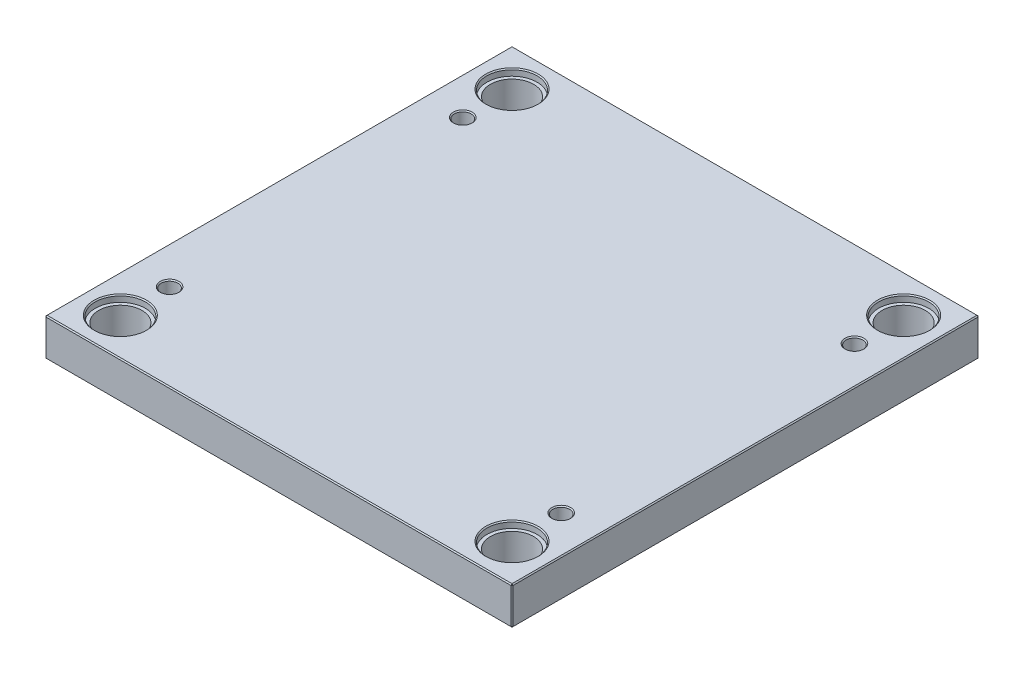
ISO-10303-21;
HEADER;
FILE_DESCRIPTION(('STEP AP214'),'2;1');
FILE_NAME('part.step','',(''),(''),'','','');
FILE_SCHEMA(('AUTOMOTIVE_DESIGN { 1 0 10303 214 1 1 1 1 }'));
ENDSEC;
DATA;
#1=APPLICATION_CONTEXT('core data for automotive mechanical design processes');
#2=APPLICATION_PROTOCOL_DEFINITION('international standard','automotive_design',2000,#1);
#3=PRODUCT_CONTEXT('',#1,'mechanical');
#4=PRODUCT('Part','Part','',(#3));
#5=PRODUCT_RELATED_PRODUCT_CATEGORY('part','',(#4));
#6=PRODUCT_DEFINITION_FORMATION('','',#4);
#7=PRODUCT_DEFINITION_CONTEXT('part definition',#1,'design');
#8=PRODUCT_DEFINITION('design','',#6,#7);
#9=PRODUCT_DEFINITION_SHAPE('','',#8);
#10=(LENGTH_UNIT() NAMED_UNIT(*) SI_UNIT(.MILLI.,.METRE.));
#11=(NAMED_UNIT(*) PLANE_ANGLE_UNIT() SI_UNIT($,.RADIAN.));
#12=(NAMED_UNIT(*) SI_UNIT($,.STERADIAN.) SOLID_ANGLE_UNIT());
#13=UNCERTAINTY_MEASURE_WITH_UNIT(LENGTH_MEASURE(1.E-05),#10,'distance_accuracy_value','');
#14=(GEOMETRIC_REPRESENTATION_CONTEXT(3) GLOBAL_UNCERTAINTY_ASSIGNED_CONTEXT((#13)) GLOBAL_UNIT_ASSIGNED_CONTEXT((#10,
#11,#12)) REPRESENTATION_CONTEXT('',''));
#15=CARTESIAN_POINT('',(0.,0.,0.));
#16=DIRECTION('',(0.,0.,1.));
#17=DIRECTION('',(1.,0.,0.));
#18=AXIS2_PLACEMENT_3D('',#15,#16,#17);
#19=CARTESIAN_POINT('',(-187.,0.,-187.));
#20=DIRECTION('',(0.,1.,0.));
#21=DIRECTION('',(0.,0.,1.));
#22=AXIS2_PLACEMENT_3D('',#19,#20,#21);
#23=CYLINDRICAL_SURFACE('',#22,20.65);
#24=CARTESIAN_POINT('',(-187.,0.999999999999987,-187.));
#25=DIRECTION('',(0.,1.,0.));
#26=DIRECTION('',(0.,0.,1.));
#27=AXIS2_PLACEMENT_3D('',#24,#25,#26);
#28=CIRCLE('',#27,20.65);
#29=CARTESIAN_POINT('',(-187.,0.999999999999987,-166.35));
#30=VERTEX_POINT('',#29);
#31=EDGE_CURVE('E472',#30,#30,#28,.F.);
#32=ORIENTED_EDGE('',*,*,#31,.T.);
#33=EDGE_LOOP('',(#32));
#34=FACE_BOUND('',#33,.T.);
#35=CARTESIAN_POINT('',(-187.,29.7,-187.));
#36=DIRECTION('',(0.,1.,0.));
#37=DIRECTION('',(0.,0.,1.));
#38=AXIS2_PLACEMENT_3D('',#35,#36,#37);
#39=CIRCLE('',#38,20.65);
#40=CARTESIAN_POINT('',(-187.,29.7,-166.35));
#41=VERTEX_POINT('',#40);
#42=EDGE_CURVE('E221',#41,#41,#39,.F.);
#43=ORIENTED_EDGE('',*,*,#42,.F.);
#44=EDGE_LOOP('',(#43));
#45=FACE_BOUND('',#44,.T.);
#46=ADVANCED_FACE('F16',(#34,#45),#23,.F.);
#47=CARTESIAN_POINT('',(187.,0.,-187.));
#48=DIRECTION('',(0.,1.,0.));
#49=DIRECTION('',(0.,0.,1.));
#50=AXIS2_PLACEMENT_3D('',#47,#48,#49);
#51=CYLINDRICAL_SURFACE('',#50,20.65);
#52=CARTESIAN_POINT('',(187.,0.999999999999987,-187.));
#53=DIRECTION('',(0.,1.,0.));
#54=DIRECTION('',(0.,0.,1.));
#55=AXIS2_PLACEMENT_3D('',#52,#53,#54);
#56=CIRCLE('',#55,20.65);
#57=CARTESIAN_POINT('',(187.,0.999999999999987,-166.35));
#58=VERTEX_POINT('',#57);
#59=EDGE_CURVE('E474',#58,#58,#56,.F.);
#60=ORIENTED_EDGE('',*,*,#59,.T.);
#61=EDGE_LOOP('',(#60));
#62=FACE_BOUND('',#61,.T.);
#63=CARTESIAN_POINT('',(187.,29.7,-187.));
#64=DIRECTION('',(0.,1.,0.));
#65=DIRECTION('',(0.,0.,1.));
#66=AXIS2_PLACEMENT_3D('',#63,#64,#65);
#67=CIRCLE('',#66,20.65);
#68=CARTESIAN_POINT('',(187.,29.7,-166.35));
#69=VERTEX_POINT('',#68);
#70=EDGE_CURVE('E218',#69,#69,#67,.F.);
#71=ORIENTED_EDGE('',*,*,#70,.F.);
#72=EDGE_LOOP('',(#71));
#73=FACE_BOUND('',#72,.T.);
#74=ADVANCED_FACE('F263',(#62,#73),#51,.F.);
#75=CARTESIAN_POINT('',(187.,0.,187.));
#76=DIRECTION('',(0.,1.,0.));
#77=DIRECTION('',(0.,0.,1.));
#78=AXIS2_PLACEMENT_3D('',#75,#76,#77);
#79=CYLINDRICAL_SURFACE('',#78,20.65);
#80=CARTESIAN_POINT('',(187.,0.99999999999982,187.));
#81=DIRECTION('',(0.,1.,0.));
#82=DIRECTION('',(0.,0.,1.));
#83=AXIS2_PLACEMENT_3D('',#80,#81,#82);
#84=CIRCLE('',#83,20.65);
#85=CARTESIAN_POINT('',(187.,0.99999999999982,207.65));
#86=VERTEX_POINT('',#85);
#87=EDGE_CURVE('E477',#86,#86,#84,.F.);
#88=ORIENTED_EDGE('',*,*,#87,.T.);
#89=EDGE_LOOP('',(#88));
#90=FACE_BOUND('',#89,.T.);
#91=CARTESIAN_POINT('',(187.,29.7,187.));
#92=DIRECTION('',(0.,1.,0.));
#93=DIRECTION('',(0.,0.,1.));
#94=AXIS2_PLACEMENT_3D('',#91,#92,#93);
#95=CIRCLE('',#94,20.65);
#96=CARTESIAN_POINT('',(187.,29.7,207.65));
#97=VERTEX_POINT('',#96);
#98=EDGE_CURVE('E214',#97,#97,#95,.F.);
#99=ORIENTED_EDGE('',*,*,#98,.F.);
#100=EDGE_LOOP('',(#99));
#101=FACE_BOUND('',#100,.T.);
#102=ADVANCED_FACE('F270',(#90,#101),#79,.F.);
#103=CARTESIAN_POINT('',(-187.,0.,187.));
#104=DIRECTION('',(0.,1.,0.));
#105=DIRECTION('',(0.,0.,1.));
#106=AXIS2_PLACEMENT_3D('',#103,#104,#105);
#107=CYLINDRICAL_SURFACE('',#106,20.65);
#108=CARTESIAN_POINT('',(-187.,0.99999999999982,187.));
#109=DIRECTION('',(0.,1.,0.));
#110=DIRECTION('',(0.,0.,1.));
#111=AXIS2_PLACEMENT_3D('',#108,#109,#110);
#112=CIRCLE('',#111,20.65);
#113=CARTESIAN_POINT('',(-187.,0.99999999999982,207.65));
#114=VERTEX_POINT('',#113);
#115=EDGE_CURVE('E480',#114,#114,#112,.F.);
#116=ORIENTED_EDGE('',*,*,#115,.T.);
#117=EDGE_LOOP('',(#116));
#118=FACE_BOUND('',#117,.T.);
#119=CARTESIAN_POINT('',(-187.,29.7,187.));
#120=DIRECTION('',(0.,1.,0.));
#121=DIRECTION('',(0.,0.,1.));
#122=AXIS2_PLACEMENT_3D('',#119,#120,#121);
#123=CIRCLE('',#122,20.65);
#124=CARTESIAN_POINT('',(-187.,29.7,207.65));
#125=VERTEX_POINT('',#124);
#126=EDGE_CURVE('E211',#125,#125,#123,.F.);
#127=ORIENTED_EDGE('',*,*,#126,.F.);
#128=EDGE_LOOP('',(#127));
#129=FACE_BOUND('',#128,.T.);
#130=ADVANCED_FACE('F277',(#118,#129),#107,.F.);
#131=CARTESIAN_POINT('',(-223.,36.,223.));
#132=DIRECTION('',(1.,0.,0.));
#133=DIRECTION('',(0.,0.,-1.));
#134=AXIS2_PLACEMENT_3D('',#131,#132,#133);
#135=PLANE('',#134);
#136=DIRECTION('',(0.,-1.,0.));
#137=VECTOR('',#136,1.);
#138=CARTESIAN_POINT('',(-223.,36.,-222.));
#139=LINE('',#138,#137);
#140=CARTESIAN_POINT('',(-223.,35.,-222.));
#141=VERTEX_POINT('',#140);
#142=CARTESIAN_POINT('',(-223.,1.,-222.));
#143=VERTEX_POINT('',#142);
#144=EDGE_CURVE('E487',#141,#143,#139,.T.);
#145=ORIENTED_EDGE('',*,*,#144,.T.);
#146=DIRECTION('',(0.,0.,1.));
#147=VECTOR('',#146,1.);
#148=CARTESIAN_POINT('',(-223.,1.,223.));
#149=LINE('',#148,#147);
#150=CARTESIAN_POINT('',(-223.,1.,222.));
#151=VERTEX_POINT('',#150);
#152=EDGE_CURVE('E490',#143,#151,#149,.T.);
#153=ORIENTED_EDGE('',*,*,#152,.T.);
#154=DIRECTION('',(0.,1.,0.));
#155=VECTOR('',#154,1.);
#156=CARTESIAN_POINT('',(-223.,36.,222.));
#157=LINE('',#156,#155);
#158=CARTESIAN_POINT('',(-223.,35.,222.));
#159=VERTEX_POINT('',#158);
#160=EDGE_CURVE('E485',#151,#159,#157,.T.);
#161=ORIENTED_EDGE('',*,*,#160,.T.);
#162=DIRECTION('',(0.,0.,-1.));
#163=VECTOR('',#162,1.);
#164=CARTESIAN_POINT('',(-223.,35.,-223.));
#165=LINE('',#164,#163);
#166=EDGE_CURVE('E483',#159,#141,#165,.T.);
#167=ORIENTED_EDGE('',*,*,#166,.T.);
#168=EDGE_LOOP('',(#145,#153,#161,#167));
#169=FACE_BOUND('',#168,.T.);
#170=ADVANCED_FACE('F298',(#169),#135,.F.);
#171=CARTESIAN_POINT('',(223.,36.,223.));
#172=DIRECTION('',(0.,0.,-1.));
#173=DIRECTION('',(-1.,0.,0.));
#174=AXIS2_PLACEMENT_3D('',#171,#172,#173);
#175=PLANE('',#174);
#176=DIRECTION('',(-1.,0.,0.));
#177=VECTOR('',#176,1.);
#178=CARTESIAN_POINT('',(-223.,35.,223.));
#179=LINE('',#178,#177);
#180=CARTESIAN_POINT('',(222.,35.,223.));
#181=VERTEX_POINT('',#180);
#182=CARTESIAN_POINT('',(-222.,35.,223.));
#183=VERTEX_POINT('',#182);
#184=EDGE_CURVE('E509',#181,#183,#179,.T.);
#185=ORIENTED_EDGE('',*,*,#184,.T.);
#186=DIRECTION('',(0.,-1.,0.));
#187=VECTOR('',#186,1.);
#188=CARTESIAN_POINT('',(-222.,36.,223.));
#189=LINE('',#188,#187);
#190=CARTESIAN_POINT('',(-222.,1.,223.));
#191=VERTEX_POINT('',#190);
#192=EDGE_CURVE('E515',#183,#191,#189,.T.);
#193=ORIENTED_EDGE('',*,*,#192,.T.);
#194=DIRECTION('',(1.,0.,0.));
#195=VECTOR('',#194,1.);
#196=CARTESIAN_POINT('',(223.,1.,223.));
#197=LINE('',#196,#195);
#198=CARTESIAN_POINT('',(222.,1.,223.));
#199=VERTEX_POINT('',#198);
#200=EDGE_CURVE('E513',#191,#199,#197,.T.);
#201=ORIENTED_EDGE('',*,*,#200,.T.);
#202=DIRECTION('',(0.,1.,0.));
#203=VECTOR('',#202,1.);
#204=CARTESIAN_POINT('',(222.,36.,223.));
#205=LINE('',#204,#203);
#206=EDGE_CURVE('E511',#199,#181,#205,.T.);
#207=ORIENTED_EDGE('',*,*,#206,.T.);
#208=EDGE_LOOP('',(#185,#193,#201,#207));
#209=FACE_BOUND('',#208,.T.);
#210=ADVANCED_FACE('F294',(#209),#175,.F.);
#211=CARTESIAN_POINT('',(223.,36.,223.));
#212=DIRECTION('',(-1.,0.,0.));
#213=DIRECTION('',(0.,0.,1.));
#214=AXIS2_PLACEMENT_3D('',#211,#212,#213);
#215=PLANE('',#214);
#216=DIRECTION('',(0.,0.,-1.));
#217=VECTOR('',#216,1.);
#218=CARTESIAN_POINT('',(223.,1.,223.));
#219=LINE('',#218,#217);
#220=CARTESIAN_POINT('',(223.,1.,222.));
#221=VERTEX_POINT('',#220);
#222=CARTESIAN_POINT('',(223.,1.,-222.));
#223=VERTEX_POINT('',#222);
#224=EDGE_CURVE('E504',#221,#223,#219,.T.);
#225=ORIENTED_EDGE('',*,*,#224,.T.);
#226=DIRECTION('',(0.,1.,0.));
#227=VECTOR('',#226,1.);
#228=CARTESIAN_POINT('',(223.,36.,-222.));
#229=LINE('',#228,#227);
#230=CARTESIAN_POINT('',(223.,35.,-222.));
#231=VERTEX_POINT('',#230);
#232=EDGE_CURVE('E506',#223,#231,#229,.T.);
#233=ORIENTED_EDGE('',*,*,#232,.T.);
#234=DIRECTION('',(0.,0.,1.));
#235=VECTOR('',#234,1.);
#236=CARTESIAN_POINT('',(223.,35.,223.));
#237=LINE('',#236,#235);
#238=CARTESIAN_POINT('',(223.,35.,222.));
#239=VERTEX_POINT('',#238);
#240=EDGE_CURVE('E500',#231,#239,#237,.T.);
#241=ORIENTED_EDGE('',*,*,#240,.T.);
#242=DIRECTION('',(0.,-1.,0.));
#243=VECTOR('',#242,1.);
#244=CARTESIAN_POINT('',(223.,36.,222.));
#245=LINE('',#244,#243);
#246=EDGE_CURVE('E502',#239,#221,#245,.T.);
#247=ORIENTED_EDGE('',*,*,#246,.T.);
#248=EDGE_LOOP('',(#225,#233,#241,#247));
#249=FACE_BOUND('',#248,.T.);
#250=ADVANCED_FACE('F290',(#249),#215,.F.);
#251=CARTESIAN_POINT('',(223.,36.,-223.));
#252=DIRECTION('',(0.,0.,1.));
#253=DIRECTION('',(1.,0.,0.));
#254=AXIS2_PLACEMENT_3D('',#251,#252,#253);
#255=PLANE('',#254);
#256=DIRECTION('',(0.,-1.,0.));
#257=VECTOR('',#256,1.);
#258=CARTESIAN_POINT('',(222.,36.,-223.));
#259=LINE('',#258,#257);
#260=CARTESIAN_POINT('',(222.,35.,-223.));
#261=VERTEX_POINT('',#260);
#262=CARTESIAN_POINT('',(222.,1.,-223.));
#263=VERTEX_POINT('',#262);
#264=EDGE_CURVE('E494',#261,#263,#259,.T.);
#265=ORIENTED_EDGE('',*,*,#264,.T.);
#266=DIRECTION('',(-1.,0.,0.));
#267=VECTOR('',#266,1.);
#268=CARTESIAN_POINT('',(223.,1.,-223.));
#269=LINE('',#268,#267);
#270=CARTESIAN_POINT('',(-222.,1.,-223.));
#271=VERTEX_POINT('',#270);
#272=EDGE_CURVE('E138',#263,#271,#269,.T.);
#273=ORIENTED_EDGE('',*,*,#272,.T.);
#274=DIRECTION('',(0.,1.,0.));
#275=VECTOR('',#274,1.);
#276=CARTESIAN_POINT('',(-222.,36.,-223.));
#277=LINE('',#276,#275);
#278=CARTESIAN_POINT('',(-222.,35.,-223.));
#279=VERTEX_POINT('',#278);
#280=EDGE_CURVE('E496',#271,#279,#277,.T.);
#281=ORIENTED_EDGE('',*,*,#280,.T.);
#282=DIRECTION('',(1.,0.,0.));
#283=VECTOR('',#282,1.);
#284=CARTESIAN_POINT('',(223.,35.,-223.));
#285=LINE('',#284,#283);
#286=EDGE_CURVE('E492',#279,#261,#285,.T.);
#287=ORIENTED_EDGE('',*,*,#286,.T.);
#288=EDGE_LOOP('',(#265,#273,#281,#287));
#289=FACE_BOUND('',#288,.T.);
#290=ADVANCED_FACE('F282',(#289),#255,.F.);
#291=CARTESIAN_POINT('',(0.,36.,0.));
#292=DIRECTION('',(0.,1.,0.));
#293=DIRECTION('',(0.,0.,1.));
#294=AXIS2_PLACEMENT_3D('',#291,#292,#293);
#295=PLANE('',#294);
#296=CARTESIAN_POINT('',(187.,36.,187.));
#297=DIRECTION('',(0.,1.,0.));
#298=DIRECTION('',(0.,0.,1.));
#299=AXIS2_PLACEMENT_3D('',#296,#297,#298);
#300=CIRCLE('',#299,25.);
#301=CARTESIAN_POINT('',(187.,36.,212.));
#302=VERTEX_POINT('',#301);
#303=EDGE_CURVE('E236',#302,#302,#300,.F.);
#304=ORIENTED_EDGE('',*,*,#303,.T.);
#305=EDGE_LOOP('',(#304));
#306=FACE_BOUND('',#305,.T.);
#307=CARTESIAN_POINT('',(-187.,36.,187.));
#308=DIRECTION('',(0.,1.,0.));
#309=DIRECTION('',(0.,0.,1.));
#310=AXIS2_PLACEMENT_3D('',#307,#308,#309);
#311=CIRCLE('',#310,25.);
#312=CARTESIAN_POINT('',(-187.,36.,212.));
#313=VERTEX_POINT('',#312);
#314=EDGE_CURVE('E233',#313,#313,#311,.F.);
#315=ORIENTED_EDGE('',*,*,#314,.T.);
#316=EDGE_LOOP('',(#315));
#317=FACE_BOUND('',#316,.T.);
#318=CARTESIAN_POINT('',(187.,36.,-187.));
#319=DIRECTION('',(0.,1.,0.));
#320=DIRECTION('',(0.,0.,1.));
#321=AXIS2_PLACEMENT_3D('',#318,#319,#320);
#322=CIRCLE('',#321,25.);
#323=CARTESIAN_POINT('',(187.,36.,-162.));
#324=VERTEX_POINT('',#323);
#325=EDGE_CURVE('E230',#324,#324,#322,.F.);
#326=ORIENTED_EDGE('',*,*,#325,.T.);
#327=EDGE_LOOP('',(#326));
#328=FACE_BOUND('',#327,.T.);
#329=CARTESIAN_POINT('',(-187.,36.,-187.));
#330=DIRECTION('',(0.,1.,0.));
#331=DIRECTION('',(0.,0.,1.));
#332=AXIS2_PLACEMENT_3D('',#329,#330,#331);
#333=CIRCLE('',#332,25.);
#334=CARTESIAN_POINT('',(-187.,36.,-162.));
#335=VERTEX_POINT('',#334);
#336=EDGE_CURVE('E227',#335,#335,#333,.F.);
#337=ORIENTED_EDGE('',*,*,#336,.T.);
#338=EDGE_LOOP('',(#337));
#339=FACE_BOUND('',#338,.T.);
#340=CARTESIAN_POINT('',(-187.,36.,140.));
#341=DIRECTION('',(0.,1.,0.));
#342=DIRECTION('',(0.,0.,1.));
#343=AXIS2_PLACEMENT_3D('',#340,#341,#342);
#344=CIRCLE('',#343,9.);
#345=CARTESIAN_POINT('',(-187.,36.,149.));
#346=VERTEX_POINT('',#345);
#347=EDGE_CURVE('E198',#346,#346,#344,.F.);
#348=ORIENTED_EDGE('',*,*,#347,.T.);
#349=EDGE_LOOP('',(#348));
#350=FACE_BOUND('',#349,.T.);
#351=CARTESIAN_POINT('',(187.,36.,140.));
#352=DIRECTION('',(0.,1.,0.));
#353=DIRECTION('',(0.,0.,1.));
#354=AXIS2_PLACEMENT_3D('',#351,#352,#353);
#355=CIRCLE('',#354,9.);
#356=CARTESIAN_POINT('',(187.,36.,149.));
#357=VERTEX_POINT('',#356);
#358=EDGE_CURVE('E195',#357,#357,#355,.F.);
#359=ORIENTED_EDGE('',*,*,#358,.T.);
#360=EDGE_LOOP('',(#359));
#361=FACE_BOUND('',#360,.T.);
#362=CARTESIAN_POINT('',(187.,36.,-140.));
#363=DIRECTION('',(0.,1.,0.));
#364=DIRECTION('',(0.,0.,1.));
#365=AXIS2_PLACEMENT_3D('',#362,#363,#364);
#366=CIRCLE('',#365,9.);
#367=CARTESIAN_POINT('',(187.,36.,-131.));
#368=VERTEX_POINT('',#367);
#369=EDGE_CURVE('E192',#368,#368,#366,.F.);
#370=ORIENTED_EDGE('',*,*,#369,.T.);
#371=EDGE_LOOP('',(#370));
#372=FACE_BOUND('',#371,.T.);
#373=CARTESIAN_POINT('',(-187.,36.,-140.));
#374=DIRECTION('',(0.,1.,0.));
#375=DIRECTION('',(0.,0.,1.));
#376=AXIS2_PLACEMENT_3D('',#373,#374,#375);
#377=CIRCLE('',#376,9.);
#378=CARTESIAN_POINT('',(-187.,36.,-131.));
#379=VERTEX_POINT('',#378);
#380=EDGE_CURVE('E188',#379,#379,#377,.F.);
#381=ORIENTED_EDGE('',*,*,#380,.T.);
#382=EDGE_LOOP('',(#381));
#383=FACE_BOUND('',#382,.T.);
#384=DIRECTION('',(0.,0.,-1.));
#385=VECTOR('',#384,1.);
#386=CARTESIAN_POINT('',(222.,36.,-223.));
#387=LINE('',#386,#385);
#388=CARTESIAN_POINT('',(222.,36.,222.));
#389=VERTEX_POINT('',#388);
#390=CARTESIAN_POINT('',(222.,36.,-222.));
#391=VERTEX_POINT('',#390);
#392=EDGE_CURVE('E31',#389,#391,#387,.T.);
#393=ORIENTED_EDGE('',*,*,#392,.T.);
#394=DIRECTION('',(-1.,0.,0.));
#395=VECTOR('',#394,1.);
#396=CARTESIAN_POINT('',(-223.,36.,-222.));
#397=LINE('',#396,#395);
#398=CARTESIAN_POINT('',(-222.,36.,-222.));
#399=VERTEX_POINT('',#398);
#400=EDGE_CURVE('E189',#391,#399,#397,.T.);
#401=ORIENTED_EDGE('',*,*,#400,.T.);
#402=DIRECTION('',(0.,0.,1.));
#403=VECTOR('',#402,1.);
#404=CARTESIAN_POINT('',(-222.,36.,223.));
#405=LINE('',#404,#403);
#406=CARTESIAN_POINT('',(-222.,36.,222.));
#407=VERTEX_POINT('',#406);
#408=EDGE_CURVE('E518',#399,#407,#405,.T.);
#409=ORIENTED_EDGE('',*,*,#408,.T.);
#410=DIRECTION('',(1.,0.,0.));
#411=VECTOR('',#410,1.);
#412=CARTESIAN_POINT('',(223.,36.,222.));
#413=LINE('',#412,#411);
#414=EDGE_CURVE('E36',#407,#389,#413,.T.);
#415=ORIENTED_EDGE('',*,*,#414,.T.);
#416=EDGE_LOOP('',(#393,#401,#409,#415));
#417=FACE_BOUND('',#416,.T.);
#418=ADVANCED_FACE('F279',(#306,#317,#328,#339,#350,#361,#372,#383,#417),#295,.T.);
#419=CARTESIAN_POINT('',(0.,0.,0.));
#420=DIRECTION('',(0.,1.,0.));
#421=DIRECTION('',(0.,0.,1.));
#422=AXIS2_PLACEMENT_3D('',#419,#420,#421);
#423=PLANE('',#422);
#424=CARTESIAN_POINT('',(-187.,0.,-187.));
#425=DIRECTION('',(0.,1.,0.));
#426=DIRECTION('',(0.,0.,1.));
#427=AXIS2_PLACEMENT_3D('',#424,#425,#426);
#428=CIRCLE('',#427,21.65);
#429=CARTESIAN_POINT('',(-187.,0.,-165.35));
#430=VERTEX_POINT('',#429);
#431=EDGE_CURVE('E469',#430,#430,#428,.T.);
#432=ORIENTED_EDGE('',*,*,#431,.T.);
#433=EDGE_LOOP('',(#432));
#434=FACE_BOUND('',#433,.T.);
#435=CARTESIAN_POINT('',(187.,0.,-187.));
#436=DIRECTION('',(0.,1.,0.));
#437=DIRECTION('',(0.,0.,1.));
#438=AXIS2_PLACEMENT_3D('',#435,#436,#437);
#439=CIRCLE('',#438,21.65);
#440=CARTESIAN_POINT('',(187.,0.,-165.35));
#441=VERTEX_POINT('',#440);
#442=EDGE_CURVE('E466',#441,#441,#439,.T.);
#443=ORIENTED_EDGE('',*,*,#442,.T.);
#444=EDGE_LOOP('',(#443));
#445=FACE_BOUND('',#444,.T.);
#446=CARTESIAN_POINT('',(187.,0.,187.));
#447=DIRECTION('',(0.,1.,0.));
#448=DIRECTION('',(0.,0.,1.));
#449=AXIS2_PLACEMENT_3D('',#446,#447,#448);
#450=CIRCLE('',#449,21.65);
#451=CARTESIAN_POINT('',(187.,0.,208.65));
#452=VERTEX_POINT('',#451);
#453=EDGE_CURVE('E463',#452,#452,#450,.T.);
#454=ORIENTED_EDGE('',*,*,#453,.T.);
#455=EDGE_LOOP('',(#454));
#456=FACE_BOUND('',#455,.T.);
#457=CARTESIAN_POINT('',(-187.,0.,187.));
#458=DIRECTION('',(0.,1.,0.));
#459=DIRECTION('',(0.,0.,1.));
#460=AXIS2_PLACEMENT_3D('',#457,#458,#459);
#461=CIRCLE('',#460,21.65);
#462=CARTESIAN_POINT('',(-187.,0.,208.65));
#463=VERTEX_POINT('',#462);
#464=EDGE_CURVE('E460',#463,#463,#461,.T.);
#465=ORIENTED_EDGE('',*,*,#464,.T.);
#466=EDGE_LOOP('',(#465));
#467=FACE_BOUND('',#466,.T.);
#468=DIRECTION('',(0.,0.,1.));
#469=VECTOR('',#468,1.);
#470=CARTESIAN_POINT('',(222.,0.,0.));
#471=LINE('',#470,#469);
#472=CARTESIAN_POINT('',(222.,0.,-222.));
#473=VERTEX_POINT('',#472);
#474=CARTESIAN_POINT('',(222.,0.,222.));
#475=VERTEX_POINT('',#474);
#476=EDGE_CURVE('E108',#473,#475,#471,.T.);
#477=ORIENTED_EDGE('',*,*,#476,.T.);
#478=DIRECTION('',(-1.,0.,0.));
#479=VECTOR('',#478,1.);
#480=CARTESIAN_POINT('',(0.,0.,222.));
#481=LINE('',#480,#479);
#482=CARTESIAN_POINT('',(-222.,0.,222.));
#483=VERTEX_POINT('',#482);
#484=EDGE_CURVE('E458',#475,#483,#481,.T.);
#485=ORIENTED_EDGE('',*,*,#484,.T.);
#486=DIRECTION('',(0.,0.,-1.));
#487=VECTOR('',#486,1.);
#488=CARTESIAN_POINT('',(-222.,0.,0.));
#489=LINE('',#488,#487);
#490=CARTESIAN_POINT('',(-222.,0.,-222.));
#491=VERTEX_POINT('',#490);
#492=EDGE_CURVE('E110',#483,#491,#489,.T.);
#493=ORIENTED_EDGE('',*,*,#492,.T.);
#494=DIRECTION('',(1.,0.,0.));
#495=VECTOR('',#494,1.);
#496=CARTESIAN_POINT('',(0.,0.,-222.));
#497=LINE('',#496,#495);
#498=EDGE_CURVE('E104',#491,#473,#497,.T.);
#499=ORIENTED_EDGE('',*,*,#498,.T.);
#500=EDGE_LOOP('',(#477,#485,#493,#499));
#501=FACE_BOUND('',#500,.T.);
#502=ADVANCED_FACE('F106',(#434,#445,#456,#467,#501),#423,.F.);
#503=CARTESIAN_POINT('',(-187.,0.,-187.));
#504=DIRECTION('',(0.,-1.,0.));
#505=DIRECTION('',(0.,0.,-1.));
#506=AXIS2_PLACEMENT_3D('',#503,#504,#505);
#507=CONICAL_SURFACE('',#506,21.65,0.785398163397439);
#508=ORIENTED_EDGE('',*,*,#31,.F.);
#509=EDGE_LOOP('',(#508));
#510=FACE_BOUND('',#509,.T.);
#511=ORIENTED_EDGE('',*,*,#431,.F.);
#512=EDGE_LOOP('',(#511));
#513=FACE_BOUND('',#512,.T.);
#514=ADVANCED_FACE('F286',(#510,#513),#507,.F.);
#515=CARTESIAN_POINT('',(187.,0.,-187.));
#516=DIRECTION('',(0.,-1.,0.));
#517=DIRECTION('',(0.,0.,-1.));
#518=AXIS2_PLACEMENT_3D('',#515,#516,#517);
#519=CONICAL_SURFACE('',#518,21.65,0.785398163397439);
#520=ORIENTED_EDGE('',*,*,#59,.F.);
#521=EDGE_LOOP('',(#520));
#522=FACE_BOUND('',#521,.T.);
#523=ORIENTED_EDGE('',*,*,#442,.F.);
#524=EDGE_LOOP('',(#523));
#525=FACE_BOUND('',#524,.T.);
#526=ADVANCED_FACE('F305',(#522,#525),#519,.F.);
#527=CARTESIAN_POINT('',(187.,0.,187.));
#528=DIRECTION('',(0.,-1.,0.));
#529=DIRECTION('',(0.,0.,-1.));
#530=AXIS2_PLACEMENT_3D('',#527,#528,#529);
#531=CONICAL_SURFACE('',#530,21.65,0.785398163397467);
#532=ORIENTED_EDGE('',*,*,#87,.F.);
#533=EDGE_LOOP('',(#532));
#534=FACE_BOUND('',#533,.T.);
#535=ORIENTED_EDGE('',*,*,#453,.F.);
#536=EDGE_LOOP('',(#535));
#537=FACE_BOUND('',#536,.T.);
#538=ADVANCED_FACE('F309',(#534,#537),#531,.F.);
#539=CARTESIAN_POINT('',(-187.,0.,187.));
#540=DIRECTION('',(0.,-1.,0.));
#541=DIRECTION('',(0.,0.,-1.));
#542=AXIS2_PLACEMENT_3D('',#539,#540,#541);
#543=CONICAL_SURFACE('',#542,21.65,0.785398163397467);
#544=ORIENTED_EDGE('',*,*,#115,.F.);
#545=EDGE_LOOP('',(#544));
#546=FACE_BOUND('',#545,.T.);
#547=ORIENTED_EDGE('',*,*,#464,.F.);
#548=EDGE_LOOP('',(#547));
#549=FACE_BOUND('',#548,.T.);
#550=ADVANCED_FACE('F313',(#546,#549),#543,.F.);
#551=CARTESIAN_POINT('',(223.,36.,222.));
#552=DIRECTION('',(-0.707106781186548,0.,-0.707106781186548));
#553=DIRECTION('',(0.,-1.,0.));
#554=AXIS2_PLACEMENT_3D('',#551,#552,#553);
#555=PLANE('',#554);
#556=DIRECTION('',(-0.707106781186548,0.,0.707106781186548));
#557=VECTOR('',#556,1.);
#558=CARTESIAN_POINT('',(222.,35.,223.));
#559=LINE('',#558,#557);
#560=EDGE_CURVE('E126',#181,#239,#559,.F.);
#561=ORIENTED_EDGE('',*,*,#560,.F.);
#562=ORIENTED_EDGE('',*,*,#206,.F.);
#563=DIRECTION('',(0.707106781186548,0.,-0.707106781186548));
#564=VECTOR('',#563,1.);
#565=CARTESIAN_POINT('',(222.,1.,223.));
#566=LINE('',#565,#564);
#567=EDGE_CURVE('E180',#221,#199,#566,.F.);
#568=ORIENTED_EDGE('',*,*,#567,.F.);
#569=ORIENTED_EDGE('',*,*,#246,.F.);
#570=EDGE_LOOP('',(#561,#562,#568,#569));
#571=FACE_BOUND('',#570,.T.);
#572=ADVANCED_FACE('F317',(#571),#555,.F.);
#573=CARTESIAN_POINT('',(222.,35.,223.));
#574=DIRECTION('',(0.577350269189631,0.577350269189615,0.577350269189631));
#575=DIRECTION('',(0.707106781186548,0.,-0.707106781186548));
#576=AXIS2_PLACEMENT_3D('',#573,#574,#575);
#577=PLANE('',#576);
#578=DIRECTION('',(0.,-0.707106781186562,0.707106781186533));
#579=VECTOR('',#578,1.);
#580=CARTESIAN_POINT('',(222.,35.,223.));
#581=LINE('',#580,#579);
#582=EDGE_CURVE('E175',#181,#389,#581,.F.);
#583=ORIENTED_EDGE('',*,*,#582,.F.);
#584=ORIENTED_EDGE('',*,*,#560,.T.);
#585=DIRECTION('',(-0.707106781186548,0.707106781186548,0.));
#586=VECTOR('',#585,1.);
#587=CARTESIAN_POINT('',(222.5,35.5,222.));
#588=LINE('',#587,#586);
#589=EDGE_CURVE('E177',#389,#239,#588,.F.);
#590=ORIENTED_EDGE('',*,*,#589,.F.);
#591=EDGE_LOOP('',(#583,#584,#590));
#592=FACE_BOUND('',#591,.T.);
#593=ADVANCED_FACE('F385',(#592),#577,.T.);
#594=CARTESIAN_POINT('',(222.,1.,223.));
#595=DIRECTION('',(0.577350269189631,-0.577350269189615,0.577350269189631));
#596=DIRECTION('',(0.707106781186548,0.,-0.707106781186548));
#597=AXIS2_PLACEMENT_3D('',#594,#595,#596);
#598=PLANE('',#597);
#599=DIRECTION('',(-0.707106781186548,-0.707106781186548,0.));
#600=VECTOR('',#599,1.);
#601=CARTESIAN_POINT('',(222.5,0.499999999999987,222.));
#602=LINE('',#601,#600);
#603=EDGE_CURVE('E124',#221,#475,#602,.T.);
#604=ORIENTED_EDGE('',*,*,#603,.F.);
#605=ORIENTED_EDGE('',*,*,#567,.T.);
#606=DIRECTION('',(0.,0.707106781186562,0.707106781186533));
#607=VECTOR('',#606,1.);
#608=CARTESIAN_POINT('',(222.,1.,223.));
#609=LINE('',#608,#607);
#610=EDGE_CURVE('E172',#475,#199,#609,.T.);
#611=ORIENTED_EDGE('',*,*,#610,.F.);
#612=EDGE_LOOP('',(#604,#605,#611));
#613=FACE_BOUND('',#612,.T.);
#614=ADVANCED_FACE('F381',(#613),#598,.T.);
#615=CARTESIAN_POINT('',(222.,36.,0.));
#616=DIRECTION('',(0.707106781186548,0.707106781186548,0.));
#617=DIRECTION('',(0.,0.,1.));
#618=AXIS2_PLACEMENT_3D('',#615,#616,#617);
#619=PLANE('',#618);
#620=ORIENTED_EDGE('',*,*,#589,.T.);
#621=ORIENTED_EDGE('',*,*,#240,.F.);
#622=DIRECTION('',(0.707106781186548,-0.707106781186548,0.));
#623=VECTOR('',#622,1.);
#624=CARTESIAN_POINT('',(223.,35.,-222.));
#625=LINE('',#624,#623);
#626=EDGE_CURVE('E166',#391,#231,#625,.T.);
#627=ORIENTED_EDGE('',*,*,#626,.F.);
#628=ORIENTED_EDGE('',*,*,#392,.F.);
#629=EDGE_LOOP('',(#620,#621,#627,#628));
#630=FACE_BOUND('',#629,.T.);
#631=ADVANCED_FACE('F377',(#630),#619,.T.);
#632=CARTESIAN_POINT('',(0.,36.,222.));
#633=DIRECTION('',(0.,0.707106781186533,0.707106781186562));
#634=DIRECTION('',(-1.,0.,0.));
#635=AXIS2_PLACEMENT_3D('',#632,#633,#634);
#636=PLANE('',#635);
#637=ORIENTED_EDGE('',*,*,#582,.T.);
#638=ORIENTED_EDGE('',*,*,#414,.F.);
#639=DIRECTION('',(0.,0.707106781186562,-0.707106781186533));
#640=VECTOR('',#639,1.);
#641=CARTESIAN_POINT('',(-222.,35.5,222.5));
#642=LINE('',#641,#640);
#643=EDGE_CURVE('E163',#183,#407,#642,.T.);
#644=ORIENTED_EDGE('',*,*,#643,.F.);
#645=ORIENTED_EDGE('',*,*,#184,.F.);
#646=EDGE_LOOP('',(#637,#638,#644,#645));
#647=FACE_BOUND('',#646,.T.);
#648=ADVANCED_FACE('F373',(#647),#636,.T.);
#649=CARTESIAN_POINT('',(-222.,36.,223.));
#650=DIRECTION('',(0.707106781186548,0.,-0.707106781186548));
#651=DIRECTION('',(0.,-1.,0.));
#652=AXIS2_PLACEMENT_3D('',#649,#650,#651);
#653=PLANE('',#652);
#654=DIRECTION('',(0.707106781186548,0.,0.707106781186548));
#655=VECTOR('',#654,1.);
#656=CARTESIAN_POINT('',(-222.,1.,223.));
#657=LINE('',#656,#655);
#658=EDGE_CURVE('E157',#191,#151,#657,.F.);
#659=ORIENTED_EDGE('',*,*,#658,.F.);
#660=ORIENTED_EDGE('',*,*,#192,.F.);
#661=DIRECTION('',(-0.707106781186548,0.,-0.707106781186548));
#662=VECTOR('',#661,1.);
#663=CARTESIAN_POINT('',(-223.,35.,222.));
#664=LINE('',#663,#662);
#665=EDGE_CURVE('E160',#159,#183,#664,.F.);
#666=ORIENTED_EDGE('',*,*,#665,.F.);
#667=ORIENTED_EDGE('',*,*,#160,.F.);
#668=EDGE_LOOP('',(#659,#660,#666,#667));
#669=FACE_BOUND('',#668,.T.);
#670=ADVANCED_FACE('F369',(#669),#653,.F.);
#671=CARTESIAN_POINT('',(223.,1.,223.));
#672=DIRECTION('',(0.,0.707106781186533,-0.707106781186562));
#673=DIRECTION('',(1.,0.,0.));
#674=AXIS2_PLACEMENT_3D('',#671,#672,#673);
#675=PLANE('',#674);
#676=ORIENTED_EDGE('',*,*,#610,.T.);
#677=ORIENTED_EDGE('',*,*,#200,.F.);
#678=DIRECTION('',(0.,-0.707106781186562,-0.707106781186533));
#679=VECTOR('',#678,1.);
#680=CARTESIAN_POINT('',(-222.,1.,223.));
#681=LINE('',#680,#679);
#682=EDGE_CURVE('E135',#483,#191,#681,.F.);
#683=ORIENTED_EDGE('',*,*,#682,.F.);
#684=ORIENTED_EDGE('',*,*,#484,.F.);
#685=EDGE_LOOP('',(#676,#677,#683,#684));
#686=FACE_BOUND('',#685,.T.);
#687=ADVANCED_FACE('F366',(#686),#675,.F.);
#688=CARTESIAN_POINT('',(223.,1.,223.));
#689=DIRECTION('',(-0.707106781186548,0.707106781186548,0.));
#690=DIRECTION('',(0.,0.,-1.));
#691=AXIS2_PLACEMENT_3D('',#688,#689,#690);
#692=PLANE('',#691);
#693=ORIENTED_EDGE('',*,*,#603,.T.);
#694=ORIENTED_EDGE('',*,*,#476,.F.);
#695=DIRECTION('',(0.707106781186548,0.707106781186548,0.));
#696=VECTOR('',#695,1.);
#697=CARTESIAN_POINT('',(222.5,0.499999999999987,-222.));
#698=LINE('',#697,#696);
#699=EDGE_CURVE('E121',#223,#473,#698,.F.);
#700=ORIENTED_EDGE('',*,*,#699,.F.);
#701=ORIENTED_EDGE('',*,*,#224,.F.);
#702=EDGE_LOOP('',(#693,#694,#700,#701));
#703=FACE_BOUND('',#702,.T.);
#704=ADVANCED_FACE('F119',(#703),#692,.F.);
#705=CARTESIAN_POINT('',(222.,36.,-223.));
#706=DIRECTION('',(-0.707106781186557,0.,0.707106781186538));
#707=DIRECTION('',(0.,-1.,0.));
#708=AXIS2_PLACEMENT_3D('',#705,#706,#707);
#709=PLANE('',#708);
#710=DIRECTION('',(0.707106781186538,0.,0.707106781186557));
#711=VECTOR('',#710,1.);
#712=CARTESIAN_POINT('',(223.,35.,-222.));
#713=LINE('',#712,#711);
#714=EDGE_CURVE('E168',#231,#261,#713,.F.);
#715=ORIENTED_EDGE('',*,*,#714,.F.);
#716=ORIENTED_EDGE('',*,*,#232,.F.);
#717=DIRECTION('',(-0.707106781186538,0.,-0.707106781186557));
#718=VECTOR('',#717,1.);
#719=CARTESIAN_POINT('',(222.,1.,-223.));
#720=LINE('',#719,#718);
#721=EDGE_CURVE('E134',#263,#223,#720,.F.);
#722=ORIENTED_EDGE('',*,*,#721,.F.);
#723=ORIENTED_EDGE('',*,*,#264,.F.);
#724=EDGE_LOOP('',(#715,#716,#722,#723));
#725=FACE_BOUND('',#724,.T.);
#726=ADVANCED_FACE('F359',(#725),#709,.F.);
#727=CARTESIAN_POINT('',(223.,35.,-222.));
#728=DIRECTION('',(0.577350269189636,0.57735026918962,-0.57735026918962));
#729=DIRECTION('',(-0.707106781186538,0.,-0.707106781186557));
#730=AXIS2_PLACEMENT_3D('',#727,#728,#729);
#731=PLANE('',#730);
#732=ORIENTED_EDGE('',*,*,#626,.T.);
#733=ORIENTED_EDGE('',*,*,#714,.T.);
#734=DIRECTION('',(0.,0.707106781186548,0.707106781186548));
#735=VECTOR('',#734,1.);
#736=CARTESIAN_POINT('',(222.,35.5,-222.5));
#737=LINE('',#736,#735);
#738=EDGE_CURVE('E152',#391,#261,#737,.F.);
#739=ORIENTED_EDGE('',*,*,#738,.F.);
#740=EDGE_LOOP('',(#732,#733,#739));
#741=FACE_BOUND('',#740,.T.);
#742=ADVANCED_FACE('F355',(#741),#731,.T.);
#743=CARTESIAN_POINT('',(-223.,35.,222.));
#744=DIRECTION('',(-0.577350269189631,0.577350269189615,0.577350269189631));
#745=DIRECTION('',(0.707106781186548,0.,0.707106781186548));
#746=AXIS2_PLACEMENT_3D('',#743,#744,#745);
#747=PLANE('',#746);
#748=ORIENTED_EDGE('',*,*,#665,.T.);
#749=ORIENTED_EDGE('',*,*,#643,.T.);
#750=DIRECTION('',(-0.707106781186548,-0.707106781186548,0.));
#751=VECTOR('',#750,1.);
#752=CARTESIAN_POINT('',(-223.,35.,222.));
#753=LINE('',#752,#751);
#754=EDGE_CURVE('E143',#159,#407,#753,.F.);
#755=ORIENTED_EDGE('',*,*,#754,.F.);
#756=EDGE_LOOP('',(#748,#749,#755));
#757=FACE_BOUND('',#756,.T.);
#758=ADVANCED_FACE('F351',(#757),#747,.T.);
#759=CARTESIAN_POINT('',(-222.,1.,223.));
#760=DIRECTION('',(-0.577350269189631,-0.577350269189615,0.577350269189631));
#761=DIRECTION('',(0.707106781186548,0.,0.707106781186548));
#762=AXIS2_PLACEMENT_3D('',#759,#760,#761);
#763=PLANE('',#762);
#764=ORIENTED_EDGE('',*,*,#682,.T.);
#765=ORIENTED_EDGE('',*,*,#658,.T.);
#766=DIRECTION('',(-0.707106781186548,0.707106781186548,0.));
#767=VECTOR('',#766,1.);
#768=CARTESIAN_POINT('',(-222.5,0.499999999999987,222.));
#769=LINE('',#768,#767);
#770=EDGE_CURVE('E139',#483,#151,#769,.T.);
#771=ORIENTED_EDGE('',*,*,#770,.F.);
#772=EDGE_LOOP('',(#764,#765,#771));
#773=FACE_BOUND('',#772,.T.);
#774=ADVANCED_FACE('F348',(#773),#763,.T.);
#775=CARTESIAN_POINT('',(222.,1.,-223.));
#776=DIRECTION('',(0.577350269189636,-0.57735026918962,-0.57735026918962));
#777=DIRECTION('',(-0.707106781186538,0.,-0.707106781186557));
#778=AXIS2_PLACEMENT_3D('',#775,#776,#777);
#779=PLANE('',#778);
#780=ORIENTED_EDGE('',*,*,#721,.T.);
#781=ORIENTED_EDGE('',*,*,#699,.T.);
#782=DIRECTION('',(0.,-0.707106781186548,0.707106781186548));
#783=VECTOR('',#782,1.);
#784=CARTESIAN_POINT('',(222.,1.,-223.));
#785=LINE('',#784,#783);
#786=EDGE_CURVE('E131',#263,#473,#785,.T.);
#787=ORIENTED_EDGE('',*,*,#786,.F.);
#788=EDGE_LOOP('',(#780,#781,#787));
#789=FACE_BOUND('',#788,.T.);
#790=ADVANCED_FACE('F130',(#789),#779,.T.);
#791=CARTESIAN_POINT('',(0.,36.,-222.));
#792=DIRECTION('',(0.,0.707106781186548,-0.707106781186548));
#793=DIRECTION('',(1.,0.,0.));
#794=AXIS2_PLACEMENT_3D('',#791,#792,#793);
#795=PLANE('',#794);
#796=ORIENTED_EDGE('',*,*,#738,.T.);
#797=ORIENTED_EDGE('',*,*,#286,.F.);
#798=DIRECTION('',(0.,-0.707106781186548,-0.707106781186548));
#799=VECTOR('',#798,1.);
#800=CARTESIAN_POINT('',(-222.,35.,-223.));
#801=LINE('',#800,#799);
#802=EDGE_CURVE('E140',#399,#279,#801,.T.);
#803=ORIENTED_EDGE('',*,*,#802,.F.);
#804=ORIENTED_EDGE('',*,*,#400,.F.);
#805=EDGE_LOOP('',(#796,#797,#803,#804));
#806=FACE_BOUND('',#805,.T.);
#807=ADVANCED_FACE('F341',(#806),#795,.T.);
#808=CARTESIAN_POINT('',(-222.,36.,0.));
#809=DIRECTION('',(-0.707106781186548,0.707106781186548,0.));
#810=DIRECTION('',(0.,0.,-1.));
#811=AXIS2_PLACEMENT_3D('',#808,#809,#810);
#812=PLANE('',#811);
#813=ORIENTED_EDGE('',*,*,#754,.T.);
#814=ORIENTED_EDGE('',*,*,#408,.F.);
#815=DIRECTION('',(0.707106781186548,0.707106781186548,0.));
#816=VECTOR('',#815,1.);
#817=CARTESIAN_POINT('',(-222.5,35.5,-222.));
#818=LINE('',#817,#816);
#819=EDGE_CURVE('E146',#141,#399,#818,.T.);
#820=ORIENTED_EDGE('',*,*,#819,.F.);
#821=ORIENTED_EDGE('',*,*,#166,.F.);
#822=EDGE_LOOP('',(#813,#814,#820,#821));
#823=FACE_BOUND('',#822,.T.);
#824=ADVANCED_FACE('F337',(#823),#812,.T.);
#825=CARTESIAN_POINT('',(-223.,1.,223.));
#826=DIRECTION('',(0.707106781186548,0.707106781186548,0.));
#827=DIRECTION('',(0.,0.,1.));
#828=AXIS2_PLACEMENT_3D('',#825,#826,#827);
#829=PLANE('',#828);
#830=ORIENTED_EDGE('',*,*,#770,.T.);
#831=ORIENTED_EDGE('',*,*,#152,.F.);
#832=DIRECTION('',(0.707106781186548,-0.707106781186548,0.));
#833=VECTOR('',#832,1.);
#834=CARTESIAN_POINT('',(-223.,1.,-222.));
#835=LINE('',#834,#833);
#836=EDGE_CURVE('E529',#491,#143,#835,.F.);
#837=ORIENTED_EDGE('',*,*,#836,.F.);
#838=ORIENTED_EDGE('',*,*,#492,.F.);
#839=EDGE_LOOP('',(#830,#831,#837,#838));
#840=FACE_BOUND('',#839,.T.);
#841=ADVANCED_FACE('F334',(#840),#829,.F.);
#842=CARTESIAN_POINT('',(223.,1.,-223.));
#843=DIRECTION('',(0.,0.707106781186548,0.707106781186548));
#844=DIRECTION('',(-1.,0.,0.));
#845=AXIS2_PLACEMENT_3D('',#842,#843,#844);
#846=PLANE('',#845);
#847=ORIENTED_EDGE('',*,*,#786,.T.);
#848=ORIENTED_EDGE('',*,*,#498,.F.);
#849=DIRECTION('',(0.,0.707106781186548,-0.707106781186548));
#850=VECTOR('',#849,1.);
#851=CARTESIAN_POINT('',(-222.,0.5,-222.5));
#852=LINE('',#851,#850);
#853=EDGE_CURVE('E526',#271,#491,#852,.F.);
#854=ORIENTED_EDGE('',*,*,#853,.F.);
#855=ORIENTED_EDGE('',*,*,#272,.F.);
#856=EDGE_LOOP('',(#847,#848,#854,#855));
#857=FACE_BOUND('',#856,.T.);
#858=ADVANCED_FACE('F137',(#857),#846,.F.);
#859=CARTESIAN_POINT('',(-222.,35.,-223.));
#860=DIRECTION('',(-0.577350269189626,0.577350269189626,-0.577350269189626));
#861=DIRECTION('',(-0.707106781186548,0.,0.707106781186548));
#862=AXIS2_PLACEMENT_3D('',#859,#860,#861);
#863=PLANE('',#862);
#864=ORIENTED_EDGE('',*,*,#819,.T.);
#865=ORIENTED_EDGE('',*,*,#802,.T.);
#866=DIRECTION('',(0.707106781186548,0.,-0.707106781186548));
#867=VECTOR('',#866,1.);
#868=CARTESIAN_POINT('',(-222.,35.,-223.));
#869=LINE('',#868,#867);
#870=EDGE_CURVE('E524',#141,#279,#869,.T.);
#871=ORIENTED_EDGE('',*,*,#870,.F.);
#872=EDGE_LOOP('',(#864,#865,#871));
#873=FACE_BOUND('',#872,.T.);
#874=ADVANCED_FACE('F327',(#873),#863,.T.);
#875=CARTESIAN_POINT('',(-223.,1.,-222.));
#876=DIRECTION('',(-0.577350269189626,-0.577350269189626,-0.577350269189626));
#877=DIRECTION('',(-0.707106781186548,0.,0.707106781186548));
#878=AXIS2_PLACEMENT_3D('',#875,#876,#877);
#879=PLANE('',#878);
#880=ORIENTED_EDGE('',*,*,#853,.T.);
#881=ORIENTED_EDGE('',*,*,#836,.T.);
#882=DIRECTION('',(-0.707106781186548,0.,0.707106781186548));
#883=VECTOR('',#882,1.);
#884=CARTESIAN_POINT('',(-223.,1.,-222.));
#885=LINE('',#884,#883);
#886=EDGE_CURVE('E455',#271,#143,#885,.T.);
#887=ORIENTED_EDGE('',*,*,#886,.F.);
#888=EDGE_LOOP('',(#880,#881,#887));
#889=FACE_BOUND('',#888,.T.);
#890=ADVANCED_FACE('F323',(#889),#879,.T.);
#891=CARTESIAN_POINT('',(-223.,36.,-222.));
#892=DIRECTION('',(0.707106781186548,0.,0.707106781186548));
#893=DIRECTION('',(0.,-1.,0.));
#894=AXIS2_PLACEMENT_3D('',#891,#892,#893);
#895=PLANE('',#894);
#896=ORIENTED_EDGE('',*,*,#870,.T.);
#897=ORIENTED_EDGE('',*,*,#280,.F.);
#898=ORIENTED_EDGE('',*,*,#886,.T.);
#899=ORIENTED_EDGE('',*,*,#144,.F.);
#900=EDGE_LOOP('',(#896,#897,#898,#899));
#901=FACE_BOUND('',#900,.T.);
#902=ADVANCED_FACE('F319',(#901),#895,.F.);
#903=CARTESIAN_POINT('',(-187.,11.,-140.));
#904=DIRECTION('',(0.,1.,0.));
#905=DIRECTION('',(0.,0.,1.));
#906=AXIS2_PLACEMENT_3D('',#903,#904,#905);
#907=CYLINDRICAL_SURFACE('',#906,8.);
#908=CARTESIAN_POINT('',(-187.,35.,-140.));
#909=DIRECTION('',(0.,1.,0.));
#910=DIRECTION('',(0.,0.,1.));
#911=AXIS2_PLACEMENT_3D('',#908,#909,#910);
#912=CIRCLE('',#911,8.);
#913=CARTESIAN_POINT('',(-187.,35.,-132.));
#914=VERTEX_POINT('',#913);
#915=EDGE_CURVE('E207',#914,#914,#912,.T.);
#916=ORIENTED_EDGE('',*,*,#915,.T.);
#917=EDGE_LOOP('',(#916));
#918=FACE_BOUND('',#917,.T.);
#919=CARTESIAN_POINT('',(-187.,11.,-140.));
#920=DIRECTION('',(0.,1.,0.));
#921=DIRECTION('',(0.,0.,1.));
#922=AXIS2_PLACEMENT_3D('',#919,#920,#921);
#923=CIRCLE('',#922,8.);
#924=CARTESIAN_POINT('',(-187.,11.,-132.));
#925=VERTEX_POINT('',#924);
#926=EDGE_CURVE('E448',#925,#925,#923,.T.);
#927=ORIENTED_EDGE('',*,*,#926,.F.);
#928=EDGE_LOOP('',(#927));
#929=FACE_BOUND('',#928,.T.);
#930=ADVANCED_FACE('F322',(#918,#929),#907,.F.);
#931=CARTESIAN_POINT('',(-187.,11.,-140.));
#932=DIRECTION('',(0.,1.,0.));
#933=DIRECTION('',(0.,0.,1.));
#934=AXIS2_PLACEMENT_3D('',#931,#932,#933);
#935=PLANE('',#934);
#936=ORIENTED_EDGE('',*,*,#926,.T.);
#937=EDGE_LOOP('',(#936));
#938=FACE_BOUND('',#937,.T.);
#939=ADVANCED_FACE('F596',(#938),#935,.T.);
#940=CARTESIAN_POINT('',(187.,11.,-140.));
#941=DIRECTION('',(0.,1.,0.));
#942=DIRECTION('',(0.,0.,1.));
#943=AXIS2_PLACEMENT_3D('',#940,#941,#942);
#944=CYLINDRICAL_SURFACE('',#943,8.);
#945=CARTESIAN_POINT('',(187.,35.,-140.));
#946=DIRECTION('',(0.,1.,0.));
#947=DIRECTION('',(0.,0.,1.));
#948=AXIS2_PLACEMENT_3D('',#945,#946,#947);
#949=CIRCLE('',#948,8.);
#950=CARTESIAN_POINT('',(187.,35.,-132.));
#951=VERTEX_POINT('',#950);
#952=EDGE_CURVE('E204',#951,#951,#949,.T.);
#953=ORIENTED_EDGE('',*,*,#952,.T.);
#954=EDGE_LOOP('',(#953));
#955=FACE_BOUND('',#954,.T.);
#956=CARTESIAN_POINT('',(187.,11.,-140.));
#957=DIRECTION('',(0.,1.,0.));
#958=DIRECTION('',(0.,0.,1.));
#959=AXIS2_PLACEMENT_3D('',#956,#957,#958);
#960=CIRCLE('',#959,8.);
#961=CARTESIAN_POINT('',(187.,11.,-132.));
#962=VERTEX_POINT('',#961);
#963=EDGE_CURVE('E445',#962,#962,#960,.T.);
#964=ORIENTED_EDGE('',*,*,#963,.F.);
#965=EDGE_LOOP('',(#964));
#966=FACE_BOUND('',#965,.T.);
#967=ADVANCED_FACE('F592',(#955,#966),#944,.F.);
#968=CARTESIAN_POINT('',(187.,11.,-140.));
#969=DIRECTION('',(0.,1.,0.));
#970=DIRECTION('',(0.,0.,1.));
#971=AXIS2_PLACEMENT_3D('',#968,#969,#970);
#972=PLANE('',#971);
#973=ORIENTED_EDGE('',*,*,#963,.T.);
#974=EDGE_LOOP('',(#973));
#975=FACE_BOUND('',#974,.T.);
#976=ADVANCED_FACE('F588',(#975),#972,.T.);
#977=CARTESIAN_POINT('',(187.,11.,140.));
#978=DIRECTION('',(0.,1.,0.));
#979=DIRECTION('',(0.,0.,1.));
#980=AXIS2_PLACEMENT_3D('',#977,#978,#979);
#981=CYLINDRICAL_SURFACE('',#980,8.);
#982=CARTESIAN_POINT('',(187.,35.,140.));
#983=DIRECTION('',(0.,1.,0.));
#984=DIRECTION('',(0.,0.,1.));
#985=AXIS2_PLACEMENT_3D('',#982,#983,#984);
#986=CIRCLE('',#985,8.);
#987=CARTESIAN_POINT('',(187.,35.,148.));
#988=VERTEX_POINT('',#987);
#989=EDGE_CURVE('E201',#988,#988,#986,.T.);
#990=ORIENTED_EDGE('',*,*,#989,.T.);
#991=EDGE_LOOP('',(#990));
#992=FACE_BOUND('',#991,.T.);
#993=CARTESIAN_POINT('',(187.,11.,140.));
#994=DIRECTION('',(0.,1.,0.));
#995=DIRECTION('',(0.,0.,1.));
#996=AXIS2_PLACEMENT_3D('',#993,#994,#995);
#997=CIRCLE('',#996,8.);
#998=CARTESIAN_POINT('',(187.,11.,148.));
#999=VERTEX_POINT('',#998);
#1000=EDGE_CURVE('E449',#999,#999,#997,.T.);
#1001=ORIENTED_EDGE('',*,*,#1000,.F.);
#1002=EDGE_LOOP('',(#1001));
#1003=FACE_BOUND('',#1002,.T.);
#1004=ADVANCED_FACE('F591',(#992,#1003),#981,.F.);
#1005=CARTESIAN_POINT('',(187.,11.,140.));
#1006=DIRECTION('',(0.,1.,0.));
#1007=DIRECTION('',(0.,0.,1.));
#1008=AXIS2_PLACEMENT_3D('',#1005,#1006,#1007);
#1009=PLANE('',#1008);
#1010=ORIENTED_EDGE('',*,*,#1000,.T.);
#1011=EDGE_LOOP('',(#1010));
#1012=FACE_BOUND('',#1011,.T.);
#1013=ADVANCED_FACE('F598',(#1012),#1009,.T.);
#1014=CARTESIAN_POINT('',(-187.,11.,140.));
#1015=DIRECTION('',(0.,1.,0.));
#1016=DIRECTION('',(0.,0.,1.));
#1017=AXIS2_PLACEMENT_3D('',#1014,#1015,#1016);
#1018=CYLINDRICAL_SURFACE('',#1017,8.);
#1019=CARTESIAN_POINT('',(-187.,35.,140.));
#1020=DIRECTION('',(0.,1.,0.));
#1021=DIRECTION('',(0.,0.,1.));
#1022=AXIS2_PLACEMENT_3D('',#1019,#1020,#1021);
#1023=CIRCLE('',#1022,8.);
#1024=CARTESIAN_POINT('',(-187.,35.,148.));
#1025=VERTEX_POINT('',#1024);
#1026=EDGE_CURVE('E185',#1025,#1025,#1023,.T.);
#1027=ORIENTED_EDGE('',*,*,#1026,.T.);
#1028=EDGE_LOOP('',(#1027));
#1029=FACE_BOUND('',#1028,.T.);
#1030=CARTESIAN_POINT('',(-187.,11.,140.));
#1031=DIRECTION('',(0.,1.,0.));
#1032=DIRECTION('',(0.,0.,1.));
#1033=AXIS2_PLACEMENT_3D('',#1030,#1031,#1032);
#1034=CIRCLE('',#1033,8.);
#1035=CARTESIAN_POINT('',(-187.,11.,148.));
#1036=VERTEX_POINT('',#1035);
#1037=EDGE_CURVE('E224',#1036,#1036,#1034,.T.);
#1038=ORIENTED_EDGE('',*,*,#1037,.F.);
#1039=EDGE_LOOP('',(#1038));
#1040=FACE_BOUND('',#1039,.T.);
#1041=ADVANCED_FACE('F601',(#1029,#1040),#1018,.F.);
#1042=CARTESIAN_POINT('',(-187.,11.,140.));
#1043=DIRECTION('',(0.,1.,0.));
#1044=DIRECTION('',(0.,0.,1.));
#1045=AXIS2_PLACEMENT_3D('',#1042,#1043,#1044);
#1046=PLANE('',#1045);
#1047=ORIENTED_EDGE('',*,*,#1037,.T.);
#1048=EDGE_LOOP('',(#1047));
#1049=FACE_BOUND('',#1048,.T.);
#1050=ADVANCED_FACE('F397',(#1049),#1046,.T.);
#1051=CARTESIAN_POINT('',(-187.,35.,140.));
#1052=DIRECTION('',(0.,1.,0.));
#1053=DIRECTION('',(0.,0.,1.));
#1054=AXIS2_PLACEMENT_3D('',#1051,#1052,#1053);
#1055=CONICAL_SURFACE('',#1054,8.,0.785398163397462);
#1056=ORIENTED_EDGE('',*,*,#347,.F.);
#1057=EDGE_LOOP('',(#1056));
#1058=FACE_BOUND('',#1057,.T.);
#1059=ORIENTED_EDGE('',*,*,#1026,.F.);
#1060=EDGE_LOOP('',(#1059));
#1061=FACE_BOUND('',#1060,.T.);
#1062=ADVANCED_FACE('F393',(#1058,#1061),#1055,.F.);
#1063=CARTESIAN_POINT('',(187.,35.,140.));
#1064=DIRECTION('',(0.,1.,0.));
#1065=DIRECTION('',(0.,0.,1.));
#1066=AXIS2_PLACEMENT_3D('',#1063,#1064,#1065);
#1067=CONICAL_SURFACE('',#1066,8.,0.785398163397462);
#1068=ORIENTED_EDGE('',*,*,#358,.F.);
#1069=EDGE_LOOP('',(#1068));
#1070=FACE_BOUND('',#1069,.T.);
#1071=ORIENTED_EDGE('',*,*,#989,.F.);
#1072=EDGE_LOOP('',(#1071));
#1073=FACE_BOUND('',#1072,.T.);
#1074=ADVANCED_FACE('F396',(#1070,#1073),#1067,.F.);
#1075=CARTESIAN_POINT('',(187.,35.,-140.));
#1076=DIRECTION('',(0.,1.,0.));
#1077=DIRECTION('',(0.,0.,1.));
#1078=AXIS2_PLACEMENT_3D('',#1075,#1076,#1077);
#1079=CONICAL_SURFACE('',#1078,8.,0.785398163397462);
#1080=ORIENTED_EDGE('',*,*,#369,.F.);
#1081=EDGE_LOOP('',(#1080));
#1082=FACE_BOUND('',#1081,.T.);
#1083=ORIENTED_EDGE('',*,*,#952,.F.);
#1084=EDGE_LOOP('',(#1083));
#1085=FACE_BOUND('',#1084,.T.);
#1086=ADVANCED_FACE('F401',(#1082,#1085),#1079,.F.);
#1087=CARTESIAN_POINT('',(-187.,35.,-140.));
#1088=DIRECTION('',(0.,1.,0.));
#1089=DIRECTION('',(0.,0.,1.));
#1090=AXIS2_PLACEMENT_3D('',#1087,#1088,#1089);
#1091=CONICAL_SURFACE('',#1090,8.,0.785398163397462);
#1092=ORIENTED_EDGE('',*,*,#380,.F.);
#1093=EDGE_LOOP('',(#1092));
#1094=FACE_BOUND('',#1093,.T.);
#1095=ORIENTED_EDGE('',*,*,#915,.F.);
#1096=EDGE_LOOP('',(#1095));
#1097=FACE_BOUND('',#1096,.T.);
#1098=ADVANCED_FACE('F405',(#1094,#1097),#1091,.F.);
#1099=CARTESIAN_POINT('',(-187.,29.7,187.));
#1100=DIRECTION('',(0.,1.,0.));
#1101=DIRECTION('',(0.,0.,1.));
#1102=AXIS2_PLACEMENT_3D('',#1099,#1100,#1101);
#1103=PLANE('',#1102);
#1104=CARTESIAN_POINT('',(-187.,29.7,187.));
#1105=DIRECTION('',(0.,1.,0.));
#1106=DIRECTION('',(0.,0.,1.));
#1107=AXIS2_PLACEMENT_3D('',#1104,#1105,#1106);
#1108=CIRCLE('',#1107,24.);
#1109=CARTESIAN_POINT('',(-187.,29.7,211.));
#1110=VERTEX_POINT('',#1109);
#1111=EDGE_CURVE('E436',#1110,#1110,#1108,.T.);
#1112=ORIENTED_EDGE('',*,*,#1111,.T.);
#1113=EDGE_LOOP('',(#1112));
#1114=FACE_BOUND('',#1113,.T.);
#1115=ORIENTED_EDGE('',*,*,#126,.T.);
#1116=EDGE_LOOP('',(#1115));
#1117=FACE_BOUND('',#1116,.T.);
#1118=ADVANCED_FACE('F409',(#1114,#1117),#1103,.T.);
#1119=CARTESIAN_POINT('',(-187.,29.7,187.));
#1120=DIRECTION('',(0.,1.,0.));
#1121=DIRECTION('',(0.,0.,1.));
#1122=AXIS2_PLACEMENT_3D('',#1119,#1120,#1121);
#1123=CYLINDRICAL_SURFACE('',#1122,24.);
#1124=CARTESIAN_POINT('',(-187.,35.,187.));
#1125=DIRECTION('',(0.,1.,0.));
#1126=DIRECTION('',(0.,0.,1.));
#1127=AXIS2_PLACEMENT_3D('',#1124,#1125,#1126);
#1128=CIRCLE('',#1127,24.);
#1129=CARTESIAN_POINT('',(-187.,35.,211.));
#1130=VERTEX_POINT('',#1129);
#1131=EDGE_CURVE('E239',#1130,#1130,#1128,.T.);
#1132=ORIENTED_EDGE('',*,*,#1131,.T.);
#1133=EDGE_LOOP('',(#1132));
#1134=FACE_BOUND('',#1133,.T.);
#1135=ORIENTED_EDGE('',*,*,#1111,.F.);
#1136=EDGE_LOOP('',(#1135));
#1137=FACE_BOUND('',#1136,.T.);
#1138=ADVANCED_FACE('F574',(#1134,#1137),#1123,.F.);
#1139=CARTESIAN_POINT('',(187.,29.7,187.));
#1140=DIRECTION('',(0.,1.,0.));
#1141=DIRECTION('',(0.,0.,1.));
#1142=AXIS2_PLACEMENT_3D('',#1139,#1140,#1141);
#1143=PLANE('',#1142);
#1144=CARTESIAN_POINT('',(187.,29.7,187.));
#1145=DIRECTION('',(0.,1.,0.));
#1146=DIRECTION('',(0.,0.,1.));
#1147=AXIS2_PLACEMENT_3D('',#1144,#1145,#1146);
#1148=CIRCLE('',#1147,24.);
#1149=CARTESIAN_POINT('',(187.,29.7,211.));
#1150=VERTEX_POINT('',#1149);
#1151=EDGE_CURVE('E433',#1150,#1150,#1148,.T.);
#1152=ORIENTED_EDGE('',*,*,#1151,.T.);
#1153=EDGE_LOOP('',(#1152));
#1154=FACE_BOUND('',#1153,.T.);
#1155=ORIENTED_EDGE('',*,*,#98,.T.);
#1156=EDGE_LOOP('',(#1155));
#1157=FACE_BOUND('',#1156,.T.);
#1158=ADVANCED_FACE('F429',(#1154,#1157),#1143,.T.);
#1159=CARTESIAN_POINT('',(187.,29.7,187.));
#1160=DIRECTION('',(0.,1.,0.));
#1161=DIRECTION('',(0.,0.,1.));
#1162=AXIS2_PLACEMENT_3D('',#1159,#1160,#1161);
#1163=CYLINDRICAL_SURFACE('',#1162,24.);
#1164=CARTESIAN_POINT('',(187.,35.,187.));
#1165=DIRECTION('',(0.,1.,0.));
#1166=DIRECTION('',(0.,0.,1.));
#1167=AXIS2_PLACEMENT_3D('',#1164,#1165,#1166);
#1168=CIRCLE('',#1167,24.);
#1169=CARTESIAN_POINT('',(187.,35.,211.));
#1170=VERTEX_POINT('',#1169);
#1171=EDGE_CURVE('E210',#1170,#1170,#1168,.T.);
#1172=ORIENTED_EDGE('',*,*,#1171,.T.);
#1173=EDGE_LOOP('',(#1172));
#1174=FACE_BOUND('',#1173,.T.);
#1175=ORIENTED_EDGE('',*,*,#1151,.F.);
#1176=EDGE_LOOP('',(#1175));
#1177=FACE_BOUND('',#1176,.T.);
#1178=ADVANCED_FACE('F425',(#1174,#1177),#1163,.F.);
#1179=CARTESIAN_POINT('',(187.,29.7,-187.));
#1180=DIRECTION('',(0.,1.,0.));
#1181=DIRECTION('',(0.,0.,1.));
#1182=AXIS2_PLACEMENT_3D('',#1179,#1180,#1181);
#1183=PLANE('',#1182);
#1184=CARTESIAN_POINT('',(187.,29.7,-187.));
#1185=DIRECTION('',(0.,1.,0.));
#1186=DIRECTION('',(0.,0.,1.));
#1187=AXIS2_PLACEMENT_3D('',#1184,#1185,#1186);
#1188=CIRCLE('',#1187,24.);
#1189=CARTESIAN_POINT('',(187.,29.7,-163.));
#1190=VERTEX_POINT('',#1189);
#1191=EDGE_CURVE('E435',#1190,#1190,#1188,.T.);
#1192=ORIENTED_EDGE('',*,*,#1191,.T.);
#1193=EDGE_LOOP('',(#1192));
#1194=FACE_BOUND('',#1193,.T.);
#1195=ORIENTED_EDGE('',*,*,#70,.T.);
#1196=EDGE_LOOP('',(#1195));
#1197=FACE_BOUND('',#1196,.T.);
#1198=ADVANCED_FACE('F428',(#1194,#1197),#1183,.T.);
#1199=CARTESIAN_POINT('',(187.,29.7,-187.));
#1200=DIRECTION('',(0.,1.,0.));
#1201=DIRECTION('',(0.,0.,1.));
#1202=AXIS2_PLACEMENT_3D('',#1199,#1200,#1201);
#1203=CYLINDRICAL_SURFACE('',#1202,24.);
#1204=CARTESIAN_POINT('',(187.,35.,-187.));
#1205=DIRECTION('',(0.,1.,0.));
#1206=DIRECTION('',(0.,0.,1.));
#1207=AXIS2_PLACEMENT_3D('',#1204,#1205,#1206);
#1208=CIRCLE('',#1207,24.);
#1209=CARTESIAN_POINT('',(187.,35.,-163.));
#1210=VERTEX_POINT('',#1209);
#1211=EDGE_CURVE('E24',#1210,#1210,#1208,.T.);
#1212=ORIENTED_EDGE('',*,*,#1211,.T.);
#1213=EDGE_LOOP('',(#1212));
#1214=FACE_BOUND('',#1213,.T.);
#1215=ORIENTED_EDGE('',*,*,#1191,.F.);
#1216=EDGE_LOOP('',(#1215));
#1217=FACE_BOUND('',#1216,.T.);
#1218=ADVANCED_FACE('F244',(#1214,#1217),#1203,.F.);
#1219=CARTESIAN_POINT('',(-187.,29.7,-187.));
#1220=DIRECTION('',(0.,1.,0.));
#1221=DIRECTION('',(0.,0.,1.));
#1222=AXIS2_PLACEMENT_3D('',#1219,#1220,#1221);
#1223=PLANE('',#1222);
#1224=CARTESIAN_POINT('',(-187.,29.7,-187.));
#1225=DIRECTION('',(0.,1.,0.));
#1226=DIRECTION('',(0.,0.,1.));
#1227=AXIS2_PLACEMENT_3D('',#1224,#1225,#1226);
#1228=CIRCLE('',#1227,24.);
#1229=CARTESIAN_POINT('',(-187.,29.7,-163.));
#1230=VERTEX_POINT('',#1229);
#1231=EDGE_CURVE('E215',#1230,#1230,#1228,.T.);
#1232=ORIENTED_EDGE('',*,*,#1231,.T.);
#1233=EDGE_LOOP('',(#1232));
#1234=FACE_BOUND('',#1233,.T.);
#1235=ORIENTED_EDGE('',*,*,#42,.T.);
#1236=EDGE_LOOP('',(#1235));
#1237=FACE_BOUND('',#1236,.T.);
#1238=ADVANCED_FACE('F418',(#1234,#1237),#1223,.T.);
#1239=CARTESIAN_POINT('',(-187.,29.7,-187.));
#1240=DIRECTION('',(0.,1.,0.));
#1241=DIRECTION('',(0.,0.,1.));
#1242=AXIS2_PLACEMENT_3D('',#1239,#1240,#1241);
#1243=CYLINDRICAL_SURFACE('',#1242,24.);
#1244=CARTESIAN_POINT('',(-187.,35.,-187.));
#1245=DIRECTION('',(0.,1.,0.));
#1246=DIRECTION('',(0.,0.,1.));
#1247=AXIS2_PLACEMENT_3D('',#1244,#1245,#1246);
#1248=CIRCLE('',#1247,24.);
#1249=CARTESIAN_POINT('',(-187.,35.,-163.));
#1250=VERTEX_POINT('',#1249);
#1251=EDGE_CURVE('E10',#1250,#1250,#1248,.T.);
#1252=ORIENTED_EDGE('',*,*,#1251,.T.);
#1253=EDGE_LOOP('',(#1252));
#1254=FACE_BOUND('',#1253,.T.);
#1255=ORIENTED_EDGE('',*,*,#1231,.F.);
#1256=EDGE_LOOP('',(#1255));
#1257=FACE_BOUND('',#1256,.T.);
#1258=ADVANCED_FACE('F412',(#1254,#1257),#1243,.F.);
#1259=CARTESIAN_POINT('',(187.,35.,187.));
#1260=DIRECTION('',(0.,1.,0.));
#1261=DIRECTION('',(0.,0.,1.));
#1262=AXIS2_PLACEMENT_3D('',#1259,#1260,#1261);
#1263=CONICAL_SURFACE('',#1262,24.,0.785398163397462);
#1264=ORIENTED_EDGE('',*,*,#303,.F.);
#1265=EDGE_LOOP('',(#1264));
#1266=FACE_BOUND('',#1265,.T.);
#1267=ORIENTED_EDGE('',*,*,#1171,.F.);
#1268=EDGE_LOOP('',(#1267));
#1269=FACE_BOUND('',#1268,.T.);
#1270=ADVANCED_FACE('F258',(#1266,#1269),#1263,.F.);
#1271=CARTESIAN_POINT('',(-187.,35.,187.));
#1272=DIRECTION('',(0.,1.,0.));
#1273=DIRECTION('',(0.,0.,1.));
#1274=AXIS2_PLACEMENT_3D('',#1271,#1272,#1273);
#1275=CONICAL_SURFACE('',#1274,24.,0.785398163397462);
#1276=ORIENTED_EDGE('',*,*,#314,.F.);
#1277=EDGE_LOOP('',(#1276));
#1278=FACE_BOUND('',#1277,.T.);
#1279=ORIENTED_EDGE('',*,*,#1131,.F.);
#1280=EDGE_LOOP('',(#1279));
#1281=FACE_BOUND('',#1280,.T.);
#1282=ADVANCED_FACE('F249',(#1278,#1281),#1275,.F.);
#1283=CARTESIAN_POINT('',(187.,35.,-187.));
#1284=DIRECTION('',(0.,1.,0.));
#1285=DIRECTION('',(0.,0.,1.));
#1286=AXIS2_PLACEMENT_3D('',#1283,#1284,#1285);
#1287=CONICAL_SURFACE('',#1286,24.,0.785398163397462);
#1288=ORIENTED_EDGE('',*,*,#325,.F.);
#1289=EDGE_LOOP('',(#1288));
#1290=FACE_BOUND('',#1289,.T.);
#1291=ORIENTED_EDGE('',*,*,#1211,.F.);
#1292=EDGE_LOOP('',(#1291));
#1293=FACE_BOUND('',#1292,.T.);
#1294=ADVANCED_FACE('F247',(#1290,#1293),#1287,.F.);
#1295=CARTESIAN_POINT('',(-187.,35.,-187.));
#1296=DIRECTION('',(0.,1.,0.));
#1297=DIRECTION('',(0.,0.,1.));
#1298=AXIS2_PLACEMENT_3D('',#1295,#1296,#1297);
#1299=CONICAL_SURFACE('',#1298,24.,0.785398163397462);
#1300=ORIENTED_EDGE('',*,*,#336,.F.);
#1301=EDGE_LOOP('',(#1300));
#1302=FACE_BOUND('',#1301,.T.);
#1303=ORIENTED_EDGE('',*,*,#1251,.F.);
#1304=EDGE_LOOP('',(#1303));
#1305=FACE_BOUND('',#1304,.T.);
#1306=ADVANCED_FACE('F18',(#1302,#1305),#1299,.F.);
#1307=CLOSED_SHELL('',(#46,#74,#102,#130,#170,#210,#250,#290,#418,#502,#514,#526,#538,#550,#572,
#593,#614,#631,#648,#670,#687,#704,#726,#742,#758,#774,#790,#807,#824,#841,#858,#874,#890,#902,
#930,#939,#967,#976,#1004,#1013,#1041,#1050,#1062,#1074,#1086,#1098,#1118,#1138,#1158,#1178,
#1198,#1218,#1238,#1258,#1270,#1282,#1294,#1306));
#1308=MANIFOLD_SOLID_BREP('B1',#1307);
#1309=ADVANCED_BREP_SHAPE_REPRESENTATION('',(#18,#1308),#14);
#1310=SHAPE_DEFINITION_REPRESENTATION(#9,#1309);
ENDSEC;
END-ISO-10303-21;
